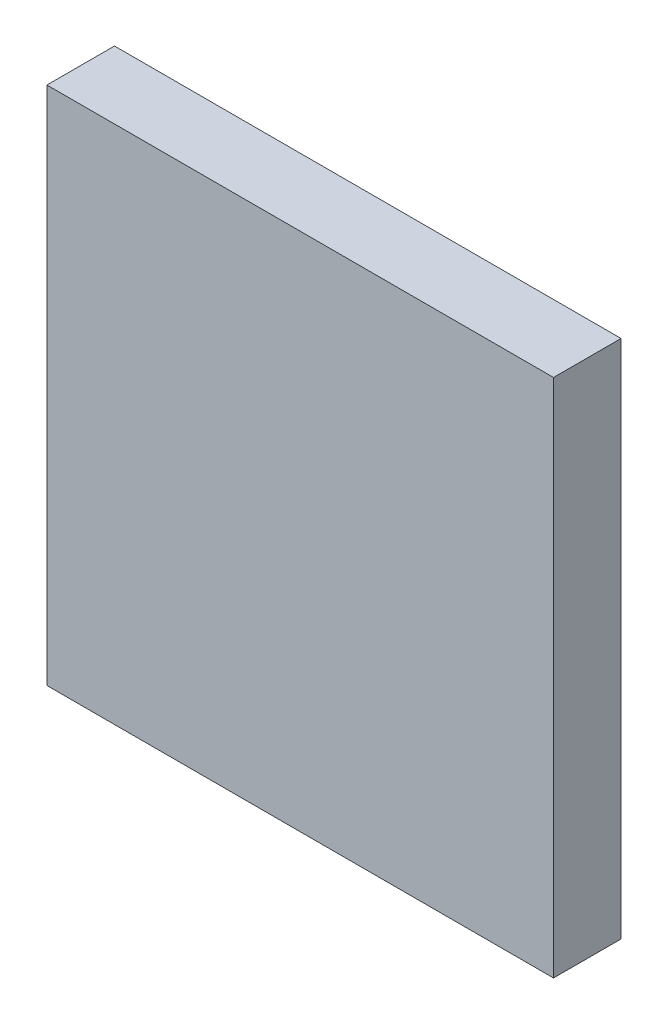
ISO-10303-21;
HEADER;
FILE_DESCRIPTION(('STEP AP214'),'2;1');
FILE_NAME('part.step','',(''),(''),'','','');
FILE_SCHEMA(('AUTOMOTIVE_DESIGN { 1 0 10303 214 1 1 1 1 }'));
ENDSEC;
DATA;
#1=APPLICATION_CONTEXT('core data for automotive mechanical design processes');
#2=APPLICATION_PROTOCOL_DEFINITION('international standard','automotive_design',2000,#1);
#3=PRODUCT_CONTEXT('',#1,'mechanical');
#4=PRODUCT('Part','Part','',(#3));
#5=PRODUCT_RELATED_PRODUCT_CATEGORY('part','',(#4));
#6=PRODUCT_DEFINITION_FORMATION('','',#4);
#7=PRODUCT_DEFINITION_CONTEXT('part definition',#1,'design');
#8=PRODUCT_DEFINITION('design','',#6,#7);
#9=PRODUCT_DEFINITION_SHAPE('','',#8);
#10=(LENGTH_UNIT() NAMED_UNIT(*) SI_UNIT(.MILLI.,.METRE.));
#11=(NAMED_UNIT(*) PLANE_ANGLE_UNIT() SI_UNIT($,.RADIAN.));
#12=(NAMED_UNIT(*) SI_UNIT($,.STERADIAN.) SOLID_ANGLE_UNIT());
#13=UNCERTAINTY_MEASURE_WITH_UNIT(LENGTH_MEASURE(1.E-05),#10,'distance_accuracy_value','');
#14=(GEOMETRIC_REPRESENTATION_CONTEXT(3) GLOBAL_UNCERTAINTY_ASSIGNED_CONTEXT((#13)) GLOBAL_UNIT_ASSIGNED_CONTEXT((#10,
#11,#12)) REPRESENTATION_CONTEXT('',''));
#15=CARTESIAN_POINT('',(0.,0.,0.));
#16=DIRECTION('',(0.,0.,1.));
#17=DIRECTION('',(1.,0.,0.));
#18=AXIS2_PLACEMENT_3D('',#15,#16,#17);
#19=CARTESIAN_POINT('',(-102.739073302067,61.6348184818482,20.));
#20=DIRECTION('',(1.,0.,0.));
#21=DIRECTION('',(0.,1.,0.));
#22=AXIS2_PLACEMENT_3D('',#19,#20,#21);
#23=PLANE('',#22);
#24=DIRECTION('',(0.,-1.,0.));
#25=VECTOR('',#24,1.);
#26=CARTESIAN_POINT('',(-102.739073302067,61.6348184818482,0.));
#27=LINE('',#26,#25);
#28=CARTESIAN_POINT('',(-102.739073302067,61.6348184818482,0.));
#29=VERTEX_POINT('',#28);
#30=CARTESIAN_POINT('',(-102.739073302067,-92.3651815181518,0.));
#31=VERTEX_POINT('',#30);
#32=EDGE_CURVE('E94',#29,#31,#27,.T.);
#33=ORIENTED_EDGE('',*,*,#32,.T.);
#34=DIRECTION('',(0.,0.,-1.));
#35=VECTOR('',#34,1.);
#36=CARTESIAN_POINT('',(-102.739073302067,-92.3651815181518,20.));
#37=LINE('',#36,#35);
#38=CARTESIAN_POINT('',(-102.739073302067,-92.3651815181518,20.));
#39=VERTEX_POINT('',#38);
#40=EDGE_CURVE('E11',#39,#31,#37,.T.);
#41=ORIENTED_EDGE('',*,*,#40,.F.);
#42=DIRECTION('',(0.,-1.,0.));
#43=VECTOR('',#42,1.);
#44=CARTESIAN_POINT('',(-102.739073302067,61.6348184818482,20.));
#45=LINE('',#44,#43);
#46=CARTESIAN_POINT('',(-102.739073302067,61.6348184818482,20.));
#47=VERTEX_POINT('',#46);
#48=EDGE_CURVE('E82',#47,#39,#45,.T.);
#49=ORIENTED_EDGE('',*,*,#48,.F.);
#50=DIRECTION('',(0.,0.,-1.));
#51=VECTOR('',#50,1.);
#52=CARTESIAN_POINT('',(-102.739073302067,61.6348184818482,20.));
#53=LINE('',#52,#51);
#54=EDGE_CURVE('E90',#47,#29,#53,.T.);
#55=ORIENTED_EDGE('',*,*,#54,.T.);
#56=EDGE_LOOP('',(#33,#41,#49,#55));
#57=FACE_BOUND('',#56,.T.);
#58=ADVANCED_FACE('F31',(#57),#23,.F.);
#59=CARTESIAN_POINT('',(-102.739073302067,-92.3651815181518,20.));
#60=DIRECTION('',(0.,1.,0.));
#61=DIRECTION('',(0.,0.,1.));
#62=AXIS2_PLACEMENT_3D('',#59,#60,#61);
#63=PLANE('',#62);
#64=DIRECTION('',(1.,0.,0.));
#65=VECTOR('',#64,1.);
#66=CARTESIAN_POINT('',(-102.739073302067,-92.3651815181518,0.));
#67=LINE('',#66,#65);
#68=CARTESIAN_POINT('',(47.2609266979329,-92.3651815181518,0.));
#69=VERTEX_POINT('',#68);
#70=EDGE_CURVE('E86',#31,#69,#67,.T.);
#71=ORIENTED_EDGE('',*,*,#70,.T.);
#72=DIRECTION('',(0.,0.,-1.));
#73=VECTOR('',#72,1.);
#74=CARTESIAN_POINT('',(47.2609266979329,-92.3651815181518,20.));
#75=LINE('',#74,#73);
#76=CARTESIAN_POINT('',(47.2609266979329,-92.3651815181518,20.));
#77=VERTEX_POINT('',#76);
#78=EDGE_CURVE('E39',#77,#69,#75,.T.);
#79=ORIENTED_EDGE('',*,*,#78,.F.);
#80=DIRECTION('',(1.,0.,0.));
#81=VECTOR('',#80,1.);
#82=CARTESIAN_POINT('',(-102.739073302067,-92.3651815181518,20.));
#83=LINE('',#82,#81);
#84=EDGE_CURVE('E77',#39,#77,#83,.T.);
#85=ORIENTED_EDGE('',*,*,#84,.F.);
#86=ORIENTED_EDGE('',*,*,#40,.T.);
#87=EDGE_LOOP('',(#71,#79,#85,#86));
#88=FACE_BOUND('',#87,.T.);
#89=ADVANCED_FACE('F85',(#88),#63,.F.);
#90=CARTESIAN_POINT('',(47.2609266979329,61.6348184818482,20.));
#91=DIRECTION('',(-1.,0.,0.));
#92=DIRECTION('',(0.,-1.,0.));
#93=AXIS2_PLACEMENT_3D('',#90,#91,#92);
#94=PLANE('',#93);
#95=DIRECTION('',(0.,1.,0.));
#96=VECTOR('',#95,1.);
#97=CARTESIAN_POINT('',(47.2609266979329,61.6348184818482,0.));
#98=LINE('',#97,#96);
#99=CARTESIAN_POINT('',(47.2609266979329,61.6348184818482,0.));
#100=VERTEX_POINT('',#99);
#101=EDGE_CURVE('E64',#69,#100,#98,.T.);
#102=ORIENTED_EDGE('',*,*,#101,.T.);
#103=DIRECTION('',(0.,0.,-1.));
#104=VECTOR('',#103,1.);
#105=CARTESIAN_POINT('',(47.2609266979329,61.6348184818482,20.));
#106=LINE('',#105,#104);
#107=CARTESIAN_POINT('',(47.2609266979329,61.6348184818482,20.));
#108=VERTEX_POINT('',#107);
#109=EDGE_CURVE('E87',#108,#100,#106,.T.);
#110=ORIENTED_EDGE('',*,*,#109,.F.);
#111=DIRECTION('',(0.,1.,0.));
#112=VECTOR('',#111,1.);
#113=CARTESIAN_POINT('',(47.2609266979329,61.6348184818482,20.));
#114=LINE('',#113,#112);
#115=EDGE_CURVE('E80',#77,#108,#114,.T.);
#116=ORIENTED_EDGE('',*,*,#115,.F.);
#117=ORIENTED_EDGE('',*,*,#78,.T.);
#118=EDGE_LOOP('',(#102,#110,#116,#117));
#119=FACE_BOUND('',#118,.T.);
#120=ADVANCED_FACE('F88',(#119),#94,.F.);
#121=CARTESIAN_POINT('',(-102.739073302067,61.6348184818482,20.));
#122=DIRECTION('',(0.,-1.,0.));
#123=DIRECTION('',(0.,0.,-1.));
#124=AXIS2_PLACEMENT_3D('',#121,#122,#123);
#125=PLANE('',#124);
#126=DIRECTION('',(-1.,0.,0.));
#127=VECTOR('',#126,1.);
#128=CARTESIAN_POINT('',(-102.739073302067,61.6348184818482,0.));
#129=LINE('',#128,#127);
#130=EDGE_CURVE('E70',#100,#29,#129,.T.);
#131=ORIENTED_EDGE('',*,*,#130,.T.);
#132=ORIENTED_EDGE('',*,*,#54,.F.);
#133=DIRECTION('',(-1.,0.,0.));
#134=VECTOR('',#133,1.);
#135=CARTESIAN_POINT('',(-102.739073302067,61.6348184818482,20.));
#136=LINE('',#135,#134);
#137=EDGE_CURVE('E47',#108,#47,#136,.T.);
#138=ORIENTED_EDGE('',*,*,#137,.F.);
#139=ORIENTED_EDGE('',*,*,#109,.T.);
#140=EDGE_LOOP('',(#131,#132,#138,#139));
#141=FACE_BOUND('',#140,.T.);
#142=ADVANCED_FACE('F101',(#141),#125,.F.);
#143=CARTESIAN_POINT('',(-102.739073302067,-92.3651815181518,20.));
#144=DIRECTION('',(0.,0.,1.));
#145=DIRECTION('',(1.,0.,0.));
#146=AXIS2_PLACEMENT_3D('',#143,#144,#145);
#147=PLANE('',#146);
#148=ORIENTED_EDGE('',*,*,#48,.T.);
#149=ORIENTED_EDGE('',*,*,#84,.T.);
#150=ORIENTED_EDGE('',*,*,#115,.T.);
#151=ORIENTED_EDGE('',*,*,#137,.T.);
#152=EDGE_LOOP('',(#148,#149,#150,#151));
#153=FACE_BOUND('',#152,.T.);
#154=ADVANCED_FACE('F78',(#153),#147,.T.);
#155=CARTESIAN_POINT('',(-102.739073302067,-92.3651815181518,0.));
#156=DIRECTION('',(0.,0.,1.));
#157=DIRECTION('',(1.,0.,0.));
#158=AXIS2_PLACEMENT_3D('',#155,#156,#157);
#159=PLANE('',#158);
#160=ORIENTED_EDGE('',*,*,#32,.F.);
#161=ORIENTED_EDGE('',*,*,#130,.F.);
#162=ORIENTED_EDGE('',*,*,#101,.F.);
#163=ORIENTED_EDGE('',*,*,#70,.F.);
#164=EDGE_LOOP('',(#160,#161,#162,#163));
#165=FACE_BOUND('',#164,.T.);
#166=ADVANCED_FACE('F104',(#165),#159,.F.);
#167=CLOSED_SHELL('',(#58,#89,#120,#142,#154,#166));
#168=MANIFOLD_SOLID_BREP('B2',#167);
#169=ADVANCED_BREP_SHAPE_REPRESENTATION('',(#18,#168),#14);
#170=SHAPE_DEFINITION_REPRESENTATION(#9,#169);
ENDSEC;
END-ISO-10303-21;
